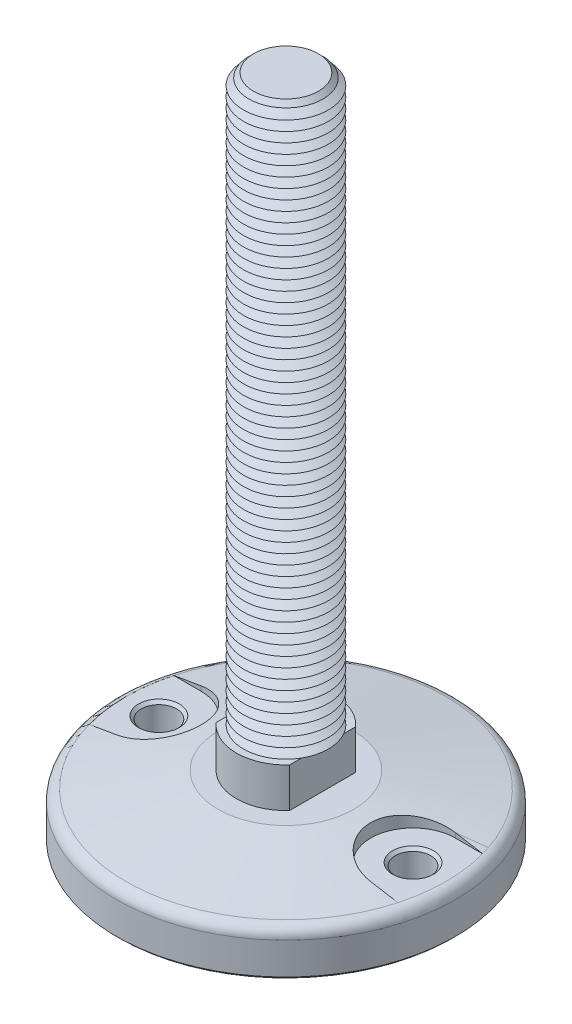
from build123d import *

# Parameters (mm, degrees)
FILLET1_R                = 4
SKETCH3_R                = 17.5
BOSS_EXTRUDE1_DEPTH      = 14
CUT_EXTRUDE1_START       = -14
CUT_EXTRUDE1_DEPTH       = 14
SKETCH5_R                = 15
BOSS_EXTRUDE2_DEPTH      = 200
CHAMFER1_SIZE            = 3.5
LPATTERN1_COUNT          = 57
LPATTERN1_PITCH          = 3.5
CUT_EXTRUDE4_DEPTH       = 5.79
SKETCH10_R               = 6.25
CUT_EXTRUDE5_DEPTH       = 16.21
CHAMFER2_SIZE            = 1
CHAMFER2_OF_MIRROR1_SIZE = 1
CHAMFER3_SIZE            = 1


with BuildPart() as part:
    # Sketch2 → Revolve1 (revolve)
    with BuildSketch(Plane(origin=(0, 0, 0), x_dir=(0, 0, -1), z_dir=(1, 0, 0))):
        Polygon((0, 0), (-24, 0), (-60, -6.347771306), (-60, -22), (0, -22), align=None)
    revolve(axis=Axis((0, 61.338865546, 0), (0, -1, 0)))

    # Fillet1
    fillet1_edges = [part.edges().sort_by_distance(p)[0] for p in [
        (0, -6.347771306, -60),
    ]]
    fillet(fillet1_edges, radius=FILLET1_R)

    # Sketch3 → Boss-Extrude1 (add)
    with BuildSketch(Plane(origin=(0, 0, 0), x_dir=(1, 0, 0), z_dir=(0, 1, 0))):
        with Locations(Location((0, 0, 0), (0, 0, 270))):
            Circle(SKETCH3_R)
    extrude(amount=BOSS_EXTRUDE1_DEPTH)

    # Sketch4 → Cut-Extrude1 (cut)
    with BuildSketch(Plane(origin=(0, 14, 0), x_dir=(1, 0, 0), z_dir=(0, 1, 0)).offset(CUT_EXTRUDE1_START)):
        with BuildLine():
            Line((-13, 11.715374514), (-13, -11.715374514))
            ThreePointArc((-13, -11.715374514), (-17.5, 0), (-13, 11.715374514))
        make_face()
        with BuildLine():
            Line((13, -11.715374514), (13, 11.715374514))
            ThreePointArc((13, 11.715374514), (17.5, 0), (13, -11.715374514))
        make_face()
    extrude(amount=CUT_EXTRUDE1_DEPTH, mode=Mode.SUBTRACT)

    # Sketch5 → Boss-Extrude2 (add)
    with BuildSketch(Plane(origin=(0, 14, 0), x_dir=(1, 0, 0), z_dir=(0, 1, 0))):
        with Locations(Location((0, 0, 0), (0, 0, 29.926434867))):
            Circle(SKETCH5_R)
    extrude(amount=BOSS_EXTRUDE2_DEPTH)

    # Chamfer1
    chamfer1_edges = [part.edges().sort_by_distance(p)[0] for p in [
        (-13, 214, 7.483314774),
    ]]
    chamfer(chamfer1_edges, length=CHAMFER1_SIZE)

    # Sketch6 → Cut-Revolve1 (revolve, cut)
    with BuildSketch(Plane(origin=(0, 0, 0), x_dir=(0, 0, -1), z_dir=(1, 0, 0))):
        Polygon((-15, 14), (-11.968911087, 15.75), (-15, 17.5), align=None)
    cut_revolve1 = revolve(axis=Axis((0, 61.338865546, 0), (0, -1, 0)), mode=Mode.SUBTRACT)

    # LPattern1: Cut-Revolve1 ×57
    with Locations(*[(0, i * LPATTERN1_PITCH, 0) for i in range(1, LPATTERN1_COUNT)]):
        add(cut_revolve1, mode=Mode.SUBTRACT)

    # Sketch8 → Cut-Extrude4 (cut)
    with BuildSketch(Plane(origin=(0, 0, 0), x_dir=(1, 0, 0), z_dir=(0, 1, 0))):
        with BuildLine():
            Line((-45, 15), (-54.674279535, 15))
            ThreePointArc((-54.674279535, 15), (-56.694592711, 0), (-54.674279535, -15))
            Line((-54.674279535, -15), (-45, -15))
            ThreePointArc((-45, -15), (-30, 0), (-45, 15))
        make_face()
    cut_extrude4 = extrude(amount=-CUT_EXTRUDE4_DEPTH, mode=Mode.SUBTRACT)

    # Sketch10 → Cut-Extrude5 (cut)
    with BuildSketch(Plane(origin=(0, -5.79, 0), x_dir=(1, 0, 0), z_dir=(0, 1, 0))):
        with Locations(Location((-45, 0, 0), (0, 0, 270))):
            Circle(SKETCH10_R)
    cut_extrude5 = extrude(amount=-CUT_EXTRUDE5_DEPTH, mode=Mode.SUBTRACT)

    # Chamfer2
    chamfer2_edges = [part.edges().sort_by_distance(p)[0] for p in [
        (-45, -5.79, -6.25),
        (-45, -22, -6.25),
    ]]
    chamfer(chamfer2_edges, length=CHAMFER2_SIZE)

    # Mirror1: Cut-Extrude4, Cut-Extrude5 across plane
    add(cut_extrude4.mirror(Plane(origin=(0, 0, 0), x_dir=(0, 0, 1), z_dir=(1, 0, 0))), mode=Mode.SUBTRACT)
    add(cut_extrude5.mirror(Plane(origin=(0, 0, 0), x_dir=(0, 0, 1), z_dir=(1, 0, 0))), mode=Mode.SUBTRACT)

    # Chamfer2 of Mirror1
    chamfer2_of_mirror1_edges = [part.edges().sort_by_distance(p)[0] for p in [
        (45, -5.79, -6.25),
        (45, -22, -6.25),
    ]]
    chamfer(chamfer2_of_mirror1_edges, length=CHAMFER2_OF_MIRROR1_SIZE)

    # Chamfer3
    chamfer3_edges = [part.edges().sort_by_distance(p)[0] for p in [
        (0, -22, -60),
    ]]
    chamfer(chamfer3_edges, length=CHAMFER3_SIZE)


solid = part.part
